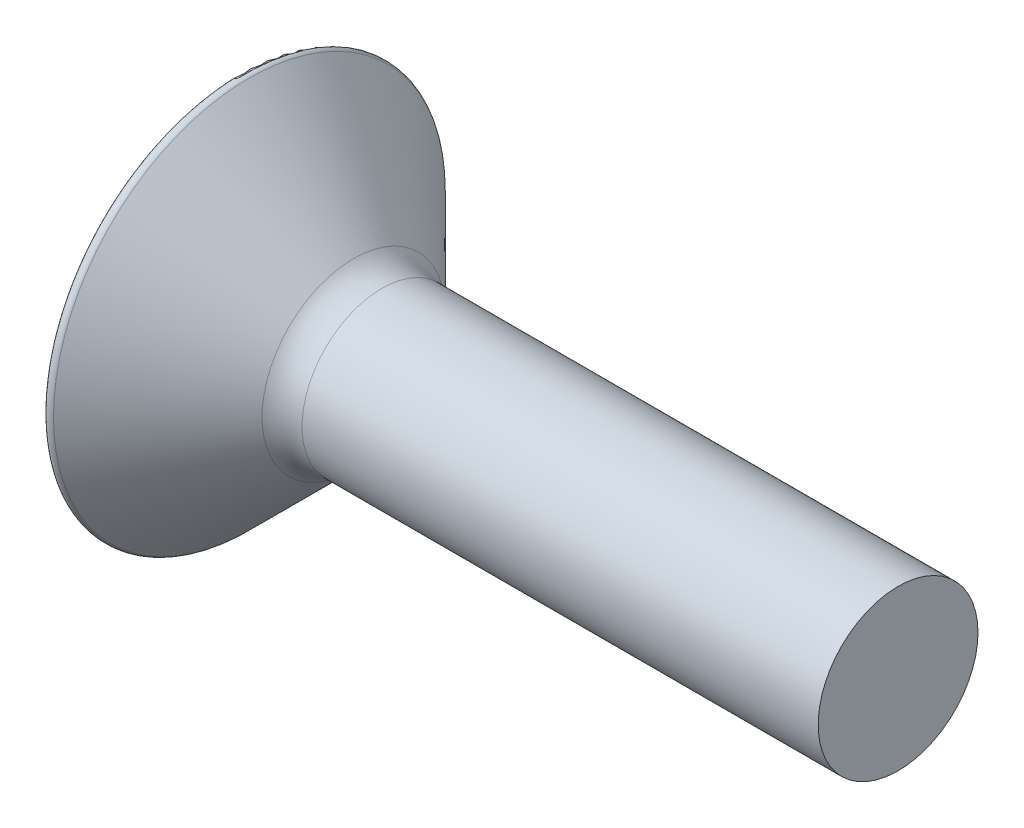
ISO-10303-21;
HEADER;
FILE_DESCRIPTION(('STEP AP214'),'2;1');
FILE_NAME('part.step','',(''),(''),'','','');
FILE_SCHEMA(('AUTOMOTIVE_DESIGN { 1 0 10303 214 1 1 1 1 }'));
ENDSEC;
DATA;
#1=APPLICATION_CONTEXT('core data for automotive mechanical design processes');
#2=APPLICATION_PROTOCOL_DEFINITION('international standard','automotive_design',2000,#1);
#3=PRODUCT_CONTEXT('',#1,'mechanical');
#4=PRODUCT('Part','Part','',(#3));
#5=PRODUCT_RELATED_PRODUCT_CATEGORY('part','',(#4));
#6=PRODUCT_DEFINITION_FORMATION('','',#4);
#7=PRODUCT_DEFINITION_CONTEXT('part definition',#1,'design');
#8=PRODUCT_DEFINITION('design','',#6,#7);
#9=PRODUCT_DEFINITION_SHAPE('','',#8);
#10=(LENGTH_UNIT() NAMED_UNIT(*) SI_UNIT(.MILLI.,.METRE.));
#11=(NAMED_UNIT(*) PLANE_ANGLE_UNIT() SI_UNIT($,.RADIAN.));
#12=(NAMED_UNIT(*) SI_UNIT($,.STERADIAN.) SOLID_ANGLE_UNIT());
#13=UNCERTAINTY_MEASURE_WITH_UNIT(LENGTH_MEASURE(1.E-05),#10,'distance_accuracy_value','');
#14=(GEOMETRIC_REPRESENTATION_CONTEXT(3) GLOBAL_UNCERTAINTY_ASSIGNED_CONTEXT((#13)) GLOBAL_UNIT_ASSIGNED_CONTEXT((#10,
#11,#12)) REPRESENTATION_CONTEXT('',''));
#15=CARTESIAN_POINT('',(0.,0.,0.));
#16=DIRECTION('',(0.,0.,1.));
#17=DIRECTION('',(1.,0.,0.));
#18=AXIS2_PLACEMENT_3D('',#15,#16,#17);
#19=CARTESIAN_POINT('',(28.3800000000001,0.,0.));
#20=DIRECTION('',(0.,0.,1.));
#21=DIRECTION('',(1.,0.,0.));
#22=AXIS2_PLACEMENT_3D('',#19,#20,#21);
#23=SPHERICAL_SURFACE('',#22,29.3800000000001);
#24=CARTESIAN_POINT('',(-0.0885355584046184,0.,0.));
#25=DIRECTION('',(1.,0.,0.));
#26=DIRECTION('',(0.,0.,-1.));
#27=AXIS2_PLACEMENT_3D('',#24,#25,#26);
#28=CIRCLE('',#27,7.26132791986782);
#29=CARTESIAN_POINT('',(-0.0885355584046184,0.,-7.26132791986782));
#30=VERTEX_POINT('',#29);
#31=EDGE_CURVE('E154',#30,#30,#28,.F.);
#32=ORIENTED_EDGE('',*,*,#31,.T.);
#33=EDGE_LOOP('',(#32));
#34=FACE_BOUND('',#33,.T.);
#35=CARTESIAN_POINT('',(28.3800000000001,-1.0375,-1.79700271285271));
#36=DIRECTION('',(0.,0.5,0.866025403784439));
#37=DIRECTION('',(0.,-0.866025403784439,0.5));
#38=AXIS2_PLACEMENT_3D('',#35,#36,#37);
#39=CIRCLE('',#38,29.3066336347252);
#40=CARTESIAN_POINT('',(-0.902137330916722,0.,-2.39600361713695));
#41=VERTEX_POINT('',#40);
#42=CARTESIAN_POINT('',(-0.902137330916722,-2.075,-1.19800180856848));
#43=VERTEX_POINT('',#42);
#44=EDGE_CURVE('E149',#41,#43,#39,.T.);
#45=ORIENTED_EDGE('',*,*,#44,.F.);
#46=CARTESIAN_POINT('',(28.3800000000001,1.0375,-1.79700271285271));
#47=DIRECTION('',(0.,-0.5,0.866025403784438));
#48=DIRECTION('',(0.,-0.866025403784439,-0.5));
#49=AXIS2_PLACEMENT_3D('',#46,#47,#48);
#50=CIRCLE('',#49,29.3066336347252);
#51=CARTESIAN_POINT('',(-0.902137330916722,2.075,-1.19800180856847));
#52=VERTEX_POINT('',#51);
#53=EDGE_CURVE('E60',#52,#41,#50,.T.);
#54=ORIENTED_EDGE('',*,*,#53,.F.);
#55=CARTESIAN_POINT('',(28.3800000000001,2.075,0.));
#56=DIRECTION('',(0.,-1.,0.));
#57=DIRECTION('',(0.,0.,-1.));
#58=AXIS2_PLACEMENT_3D('',#55,#56,#57);
#59=CIRCLE('',#58,29.3066336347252);
#60=CARTESIAN_POINT('',(-0.902137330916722,2.075,1.19800180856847));
#61=VERTEX_POINT('',#60);
#62=EDGE_CURVE('E146',#61,#52,#59,.T.);
#63=ORIENTED_EDGE('',*,*,#62,.F.);
#64=CARTESIAN_POINT('',(28.3800000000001,1.0375,1.79700271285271));
#65=DIRECTION('',(0.,-0.5,-0.866025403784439));
#66=DIRECTION('',(0.,0.866025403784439,-0.5));
#67=AXIS2_PLACEMENT_3D('',#64,#65,#66);
#68=CIRCLE('',#67,29.3066336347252);
#69=CARTESIAN_POINT('',(-0.902137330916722,0.,2.39600361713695));
#70=VERTEX_POINT('',#69);
#71=EDGE_CURVE('E128',#70,#61,#68,.T.);
#72=ORIENTED_EDGE('',*,*,#71,.F.);
#73=CARTESIAN_POINT('',(28.3800000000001,-1.0375,1.79700271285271));
#74=DIRECTION('',(0.,0.5,-0.866025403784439));
#75=DIRECTION('',(0.,0.866025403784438,0.5));
#76=AXIS2_PLACEMENT_3D('',#73,#74,#75);
#77=CIRCLE('',#76,29.3066336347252);
#78=CARTESIAN_POINT('',(-0.902137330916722,-2.075,1.19800180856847));
#79=VERTEX_POINT('',#78);
#80=EDGE_CURVE('E143',#79,#70,#77,.T.);
#81=ORIENTED_EDGE('',*,*,#80,.F.);
#82=CARTESIAN_POINT('',(28.3800000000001,-2.075,0.));
#83=DIRECTION('',(0.,1.,0.));
#84=DIRECTION('',(0.,0.,1.));
#85=AXIS2_PLACEMENT_3D('',#82,#83,#84);
#86=CIRCLE('',#85,29.3066336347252);
#87=EDGE_CURVE('E141',#43,#79,#86,.T.);
#88=ORIENTED_EDGE('',*,*,#87,.F.);
#89=EDGE_LOOP('',(#45,#54,#63,#72,#81,#88));
#90=FACE_BOUND('',#89,.T.);
#91=ADVANCED_FACE('F37',(#34,#90),#23,.T.);
#92=CARTESIAN_POINT('',(4.6,0.,0.));
#93=DIRECTION('',(-1.,0.,0.));
#94=DIRECTION('',(0.,0.,-1.));
#95=AXIS2_PLACEMENT_3D('',#92,#93,#94);
#96=CONICAL_SURFACE('',#95,3.,0.78539816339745);
#97=CARTESIAN_POINT('',(4.16066017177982,0.,0.));
#98=DIRECTION('',(1.,0.,0.));
#99=DIRECTION('',(0.,0.,-1.));
#100=AXIS2_PLACEMENT_3D('',#97,#98,#99);
#101=CIRCLE('',#100,3.43933982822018);
#102=CARTESIAN_POINT('',(4.16066017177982,0.,-3.43933982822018));
#103=VERTEX_POINT('',#102);
#104=EDGE_CURVE('E11',#103,#103,#101,.F.);
#105=ORIENTED_EDGE('',*,*,#104,.T.);
#106=EDGE_LOOP('',(#105));
#107=FACE_BOUND('',#106,.T.);
#108=CARTESIAN_POINT('',(0.246681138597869,0.,0.));
#109=DIRECTION('',(-1.,0.,0.));
#110=DIRECTION('',(0.,0.,1.));
#111=AXIS2_PLACEMENT_3D('',#108,#109,#110);
#112=CIRCLE('',#111,7.35331886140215);
#113=CARTESIAN_POINT('',(0.246681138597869,0.,7.35331886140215));
#114=VERTEX_POINT('',#113);
#115=EDGE_CURVE('E151',#114,#114,#112,.F.);
#116=ORIENTED_EDGE('',*,*,#115,.T.);
#117=EDGE_LOOP('',(#116));
#118=FACE_BOUND('',#117,.T.);
#119=ADVANCED_FACE('F171',(#107,#118),#96,.T.);
#120=CARTESIAN_POINT('',(24.6,0.,0.));
#121=DIRECTION('',(-1.,0.,0.));
#122=DIRECTION('',(0.,0.,1.));
#123=AXIS2_PLACEMENT_3D('',#120,#121,#122);
#124=CYLINDRICAL_SURFACE('',#123,3.);
#125=CARTESIAN_POINT('',(5.22132034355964,0.,0.));
#126=DIRECTION('',(1.,0.,0.));
#127=DIRECTION('',(0.,0.,-1.));
#128=AXIS2_PLACEMENT_3D('',#125,#126,#127);
#129=CIRCLE('',#128,3.);
#130=CARTESIAN_POINT('',(5.22132034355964,0.,-3.));
#131=VERTEX_POINT('',#130);
#132=EDGE_CURVE('E45',#131,#131,#129,.T.);
#133=ORIENTED_EDGE('',*,*,#132,.T.);
#134=EDGE_LOOP('',(#133));
#135=FACE_BOUND('',#134,.T.);
#136=CARTESIAN_POINT('',(24.6,0.,0.));
#137=DIRECTION('',(1.,0.,0.));
#138=DIRECTION('',(0.,0.,-1.));
#139=AXIS2_PLACEMENT_3D('',#136,#137,#138);
#140=CIRCLE('',#139,3.);
#141=CARTESIAN_POINT('',(24.6,0.,-3.));
#142=VERTEX_POINT('',#141);
#143=EDGE_CURVE('E138',#142,#142,#140,.T.);
#144=ORIENTED_EDGE('',*,*,#143,.F.);
#145=EDGE_LOOP('',(#144));
#146=FACE_BOUND('',#145,.T.);
#147=ADVANCED_FACE('F159',(#135,#146),#124,.T.);
#148=CARTESIAN_POINT('',(24.6,0.,0.));
#149=DIRECTION('',(1.,0.,0.));
#150=DIRECTION('',(0.,0.,-1.));
#151=AXIS2_PLACEMENT_3D('',#148,#149,#150);
#152=PLANE('',#151);
#153=ORIENTED_EDGE('',*,*,#143,.T.);
#154=EDGE_LOOP('',(#153));
#155=FACE_BOUND('',#154,.T.);
#156=ADVANCED_FACE('F183',(#155),#152,.T.);
#157=CARTESIAN_POINT('',(2.,-2.075,-1.19800180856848));
#158=DIRECTION('',(0.,0.5,0.866025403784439));
#159=DIRECTION('',(0.,-0.866025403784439,0.5));
#160=AXIS2_PLACEMENT_3D('',#157,#158,#159);
#161=PLANE('',#160);
#162=ORIENTED_EDGE('',*,*,#44,.T.);
#163=DIRECTION('',(-1.,0.,0.));
#164=VECTOR('',#163,1.);
#165=CARTESIAN_POINT('',(2.,-2.075,-1.19800180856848));
#166=LINE('',#165,#164);
#167=CARTESIAN_POINT('',(2.,-2.075,-1.19800180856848));
#168=VERTEX_POINT('',#167);
#169=EDGE_CURVE('E52',#168,#43,#166,.T.);
#170=ORIENTED_EDGE('',*,*,#169,.F.);
#171=DIRECTION('',(0.,0.866025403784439,-0.5));
#172=VECTOR('',#171,1.);
#173=CARTESIAN_POINT('',(2.,-2.075,-1.19800180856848));
#174=LINE('',#173,#172);
#175=CARTESIAN_POINT('',(2.,0.,-2.39600361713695));
#176=VERTEX_POINT('',#175);
#177=EDGE_CURVE('E337',#168,#176,#174,.T.);
#178=ORIENTED_EDGE('',*,*,#177,.T.);
#179=DIRECTION('',(-1.,0.,0.));
#180=VECTOR('',#179,1.);
#181=CARTESIAN_POINT('',(2.,0.,-2.39600361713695));
#182=LINE('',#181,#180);
#183=EDGE_CURVE('E131',#176,#41,#182,.T.);
#184=ORIENTED_EDGE('',*,*,#183,.T.);
#185=EDGE_LOOP('',(#162,#170,#178,#184));
#186=FACE_BOUND('',#185,.T.);
#187=ADVANCED_FACE('F186',(#186),#161,.T.);
#188=CARTESIAN_POINT('',(2.,0.,-2.39600361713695));
#189=DIRECTION('',(0.,-0.5,0.866025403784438));
#190=DIRECTION('',(0.,-0.866025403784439,-0.5));
#191=AXIS2_PLACEMENT_3D('',#188,#189,#190);
#192=PLANE('',#191);
#193=ORIENTED_EDGE('',*,*,#53,.T.);
#194=ORIENTED_EDGE('',*,*,#183,.F.);
#195=DIRECTION('',(0.,0.866025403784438,0.5));
#196=VECTOR('',#195,1.);
#197=CARTESIAN_POINT('',(2.,0.,-2.39600361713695));
#198=LINE('',#197,#196);
#199=CARTESIAN_POINT('',(2.,2.075,-1.19800180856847));
#200=VERTEX_POINT('',#199);
#201=EDGE_CURVE('E124',#176,#200,#198,.T.);
#202=ORIENTED_EDGE('',*,*,#201,.T.);
#203=DIRECTION('',(-1.,0.,0.));
#204=VECTOR('',#203,1.);
#205=CARTESIAN_POINT('',(2.,2.075,-1.19800180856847));
#206=LINE('',#205,#204);
#207=EDGE_CURVE('E123',#200,#52,#206,.T.);
#208=ORIENTED_EDGE('',*,*,#207,.T.);
#209=EDGE_LOOP('',(#193,#194,#202,#208));
#210=FACE_BOUND('',#209,.T.);
#211=ADVANCED_FACE('F190',(#210),#192,.T.);
#212=CARTESIAN_POINT('',(2.,2.075,-1.19800180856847));
#213=DIRECTION('',(0.,-1.,0.));
#214=DIRECTION('',(0.,0.,-1.));
#215=AXIS2_PLACEMENT_3D('',#212,#213,#214);
#216=PLANE('',#215);
#217=ORIENTED_EDGE('',*,*,#62,.T.);
#218=ORIENTED_EDGE('',*,*,#207,.F.);
#219=DIRECTION('',(0.,0.,1.));
#220=VECTOR('',#219,1.);
#221=CARTESIAN_POINT('',(2.,2.075,-1.19800180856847));
#222=LINE('',#221,#220);
#223=CARTESIAN_POINT('',(2.,2.075,1.19800180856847));
#224=VERTEX_POINT('',#223);
#225=EDGE_CURVE('E100',#200,#224,#222,.T.);
#226=ORIENTED_EDGE('',*,*,#225,.T.);
#227=DIRECTION('',(-1.,0.,0.));
#228=VECTOR('',#227,1.);
#229=CARTESIAN_POINT('',(2.,2.075,1.19800180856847));
#230=LINE('',#229,#228);
#231=EDGE_CURVE('E121',#224,#61,#230,.T.);
#232=ORIENTED_EDGE('',*,*,#231,.T.);
#233=EDGE_LOOP('',(#217,#218,#226,#232));
#234=FACE_BOUND('',#233,.T.);
#235=ADVANCED_FACE('F120',(#234),#216,.T.);
#236=CARTESIAN_POINT('',(2.,2.075,1.19800180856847));
#237=DIRECTION('',(0.,-0.5,-0.866025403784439));
#238=DIRECTION('',(0.,0.866025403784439,-0.5));
#239=AXIS2_PLACEMENT_3D('',#236,#237,#238);
#240=PLANE('',#239);
#241=ORIENTED_EDGE('',*,*,#71,.T.);
#242=ORIENTED_EDGE('',*,*,#231,.F.);
#243=DIRECTION('',(0.,-0.866025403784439,0.5));
#244=VECTOR('',#243,1.);
#245=CARTESIAN_POINT('',(2.,2.075,1.19800180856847));
#246=LINE('',#245,#244);
#247=CARTESIAN_POINT('',(2.,0.,2.39600361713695));
#248=VERTEX_POINT('',#247);
#249=EDGE_CURVE('E107',#224,#248,#246,.T.);
#250=ORIENTED_EDGE('',*,*,#249,.T.);
#251=DIRECTION('',(-1.,0.,0.));
#252=VECTOR('',#251,1.);
#253=CARTESIAN_POINT('',(2.,0.,2.39600361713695));
#254=LINE('',#253,#252);
#255=EDGE_CURVE('E129',#248,#70,#254,.T.);
#256=ORIENTED_EDGE('',*,*,#255,.T.);
#257=EDGE_LOOP('',(#241,#242,#250,#256));
#258=FACE_BOUND('',#257,.T.);
#259=ADVANCED_FACE('F126',(#258),#240,.T.);
#260=CARTESIAN_POINT('',(2.,0.,2.39600361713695));
#261=DIRECTION('',(0.,0.5,-0.866025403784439));
#262=DIRECTION('',(0.,0.866025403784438,0.5));
#263=AXIS2_PLACEMENT_3D('',#260,#261,#262);
#264=PLANE('',#263);
#265=ORIENTED_EDGE('',*,*,#80,.T.);
#266=ORIENTED_EDGE('',*,*,#255,.F.);
#267=DIRECTION('',(0.,-0.866025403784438,-0.5));
#268=VECTOR('',#267,1.);
#269=CARTESIAN_POINT('',(2.,0.,2.39600361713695));
#270=LINE('',#269,#268);
#271=CARTESIAN_POINT('',(2.,-2.075,1.19800180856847));
#272=VERTEX_POINT('',#271);
#273=EDGE_CURVE('E115',#248,#272,#270,.T.);
#274=ORIENTED_EDGE('',*,*,#273,.T.);
#275=DIRECTION('',(-1.,0.,0.));
#276=VECTOR('',#275,1.);
#277=CARTESIAN_POINT('',(2.,-2.075,1.19800180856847));
#278=LINE('',#277,#276);
#279=EDGE_CURVE('E133',#272,#79,#278,.T.);
#280=ORIENTED_EDGE('',*,*,#279,.T.);
#281=EDGE_LOOP('',(#265,#266,#274,#280));
#282=FACE_BOUND('',#281,.T.);
#283=ADVANCED_FACE('F198',(#282),#264,.T.);
#284=CARTESIAN_POINT('',(2.,-2.075,1.19800180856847));
#285=DIRECTION('',(0.,1.,0.));
#286=DIRECTION('',(0.,0.,1.));
#287=AXIS2_PLACEMENT_3D('',#284,#285,#286);
#288=PLANE('',#287);
#289=ORIENTED_EDGE('',*,*,#87,.T.);
#290=ORIENTED_EDGE('',*,*,#279,.F.);
#291=DIRECTION('',(0.,0.,-1.));
#292=VECTOR('',#291,1.);
#293=CARTESIAN_POINT('',(2.,-2.075,1.19800180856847));
#294=LINE('',#293,#292);
#295=EDGE_CURVE('E350',#272,#168,#294,.T.);
#296=ORIENTED_EDGE('',*,*,#295,.T.);
#297=ORIENTED_EDGE('',*,*,#169,.T.);
#298=EDGE_LOOP('',(#289,#290,#296,#297));
#299=FACE_BOUND('',#298,.T.);
#300=ADVANCED_FACE('F201',(#299),#288,.T.);
#301=CARTESIAN_POINT('',(2.,2.075,1.19800180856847));
#302=DIRECTION('',(0.86602540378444,0.249999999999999,0.433012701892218));
#303=DIRECTION('',(0.447213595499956,0.,-0.894427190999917));
#304=AXIS2_PLACEMENT_3D('',#301,#302,#303);
#305=PLANE('',#304);
#306=ORIENTED_EDGE('',*,*,#249,.F.);
#307=DIRECTION('',(-0.447213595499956,0.774596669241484,0.447213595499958));
#308=VECTOR('',#307,1.);
#309=CARTESIAN_POINT('',(2.,2.075,1.19800180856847));
#310=LINE('',#309,#308);
#311=CARTESIAN_POINT('',(3.19800180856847,0.,0.));
#312=VERTEX_POINT('',#311);
#313=EDGE_CURVE('E96',#312,#224,#310,.T.);
#314=ORIENTED_EDGE('',*,*,#313,.F.);
#315=DIRECTION('',(-0.447213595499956,0.,0.894427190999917));
#316=VECTOR('',#315,1.);
#317=CARTESIAN_POINT('',(2.,0.,2.39600361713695));
#318=LINE('',#317,#316);
#319=EDGE_CURVE('E109',#312,#248,#318,.T.);
#320=ORIENTED_EDGE('',*,*,#319,.T.);
#321=EDGE_LOOP('',(#306,#314,#320));
#322=FACE_BOUND('',#321,.T.);
#323=ADVANCED_FACE('F108',(#322),#305,.F.);
#324=CARTESIAN_POINT('',(2.,0.,2.39600361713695));
#325=DIRECTION('',(0.86602540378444,-0.249999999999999,0.433012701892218));
#326=DIRECTION('',(0.447213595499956,0.,-0.894427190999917));
#327=AXIS2_PLACEMENT_3D('',#324,#325,#326);
#328=PLANE('',#327);
#329=ORIENTED_EDGE('',*,*,#273,.F.);
#330=ORIENTED_EDGE('',*,*,#319,.F.);
#331=DIRECTION('',(-0.447213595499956,-0.774596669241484,0.447213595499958));
#332=VECTOR('',#331,1.);
#333=CARTESIAN_POINT('',(2.,-2.075,1.19800180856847));
#334=LINE('',#333,#332);
#335=EDGE_CURVE('E343',#312,#272,#334,.T.);
#336=ORIENTED_EDGE('',*,*,#335,.T.);
#337=EDGE_LOOP('',(#329,#330,#336));
#338=FACE_BOUND('',#337,.T.);
#339=ADVANCED_FACE('F205',(#338),#328,.F.);
#340=CARTESIAN_POINT('',(2.,-2.075,1.19800180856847));
#341=DIRECTION('',(0.86602540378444,-0.499999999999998,0.));
#342=DIRECTION('',(0.499999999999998,0.86602540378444,0.));
#343=AXIS2_PLACEMENT_3D('',#340,#341,#342);
#344=PLANE('',#343);
#345=ORIENTED_EDGE('',*,*,#295,.F.);
#346=ORIENTED_EDGE('',*,*,#335,.F.);
#347=DIRECTION('',(-0.447213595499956,-0.774596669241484,-0.447213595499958));
#348=VECTOR('',#347,1.);
#349=CARTESIAN_POINT('',(2.,-2.075,-1.19800180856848));
#350=LINE('',#349,#348);
#351=EDGE_CURVE('E357',#312,#168,#350,.T.);
#352=ORIENTED_EDGE('',*,*,#351,.T.);
#353=EDGE_LOOP('',(#345,#346,#352));
#354=FACE_BOUND('',#353,.T.);
#355=ADVANCED_FACE('F208',(#354),#344,.F.);
#356=CARTESIAN_POINT('',(2.,-2.075,-1.19800180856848));
#357=DIRECTION('',(0.86602540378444,-0.249999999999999,-0.433012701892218));
#358=DIRECTION('',(-0.447213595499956,0.,-0.894427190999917));
#359=AXIS2_PLACEMENT_3D('',#356,#357,#358);
#360=PLANE('',#359);
#361=ORIENTED_EDGE('',*,*,#177,.F.);
#362=ORIENTED_EDGE('',*,*,#351,.F.);
#363=DIRECTION('',(-0.447213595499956,0.,-0.894427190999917));
#364=VECTOR('',#363,1.);
#365=CARTESIAN_POINT('',(2.,0.,-2.39600361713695));
#366=LINE('',#365,#364);
#367=EDGE_CURVE('E336',#312,#176,#366,.T.);
#368=ORIENTED_EDGE('',*,*,#367,.T.);
#369=EDGE_LOOP('',(#361,#362,#368));
#370=FACE_BOUND('',#369,.T.);
#371=ADVANCED_FACE('F212',(#370),#360,.F.);
#372=CARTESIAN_POINT('',(2.,0.,-2.39600361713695));
#373=DIRECTION('',(0.86602540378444,0.249999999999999,-0.433012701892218));
#374=DIRECTION('',(-0.447213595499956,0.,-0.894427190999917));
#375=AXIS2_PLACEMENT_3D('',#372,#373,#374);
#376=PLANE('',#375);
#377=ORIENTED_EDGE('',*,*,#201,.F.);
#378=ORIENTED_EDGE('',*,*,#367,.F.);
#379=DIRECTION('',(-0.447213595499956,0.774596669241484,-0.447213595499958));
#380=VECTOR('',#379,1.);
#381=CARTESIAN_POINT('',(2.,2.075,-1.19800180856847));
#382=LINE('',#381,#380);
#383=EDGE_CURVE('E102',#312,#200,#382,.T.);
#384=ORIENTED_EDGE('',*,*,#383,.T.);
#385=EDGE_LOOP('',(#377,#378,#384));
#386=FACE_BOUND('',#385,.T.);
#387=ADVANCED_FACE('F216',(#386),#376,.F.);
#388=CARTESIAN_POINT('',(2.,2.075,-1.19800180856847));
#389=DIRECTION('',(0.86602540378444,0.499999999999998,0.));
#390=DIRECTION('',(-0.499999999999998,0.86602540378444,0.));
#391=AXIS2_PLACEMENT_3D('',#388,#389,#390);
#392=PLANE('',#391);
#393=ORIENTED_EDGE('',*,*,#225,.F.);
#394=ORIENTED_EDGE('',*,*,#383,.F.);
#395=ORIENTED_EDGE('',*,*,#313,.T.);
#396=EDGE_LOOP('',(#393,#394,#395));
#397=FACE_BOUND('',#396,.T.);
#398=ADVANCED_FACE('F98',(#397),#392,.F.);
#399=CARTESIAN_POINT('',(0.105259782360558,0.,0.));
#400=DIRECTION('',(1.,0.,0.));
#401=DIRECTION('',(0.,0.,-1.));
#402=AXIS2_PLACEMENT_3D('',#399,#400,#401);
#403=TOROIDAL_SURFACE('',#402,7.21189750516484,0.2);
#404=ORIENTED_EDGE('',*,*,#31,.F.);
#405=EDGE_LOOP('',(#404));
#406=FACE_BOUND('',#405,.T.);
#407=ORIENTED_EDGE('',*,*,#115,.F.);
#408=EDGE_LOOP('',(#407));
#409=FACE_BOUND('',#408,.T.);
#410=ADVANCED_FACE('F163',(#406,#409),#403,.T.);
#411=CARTESIAN_POINT('',(5.22132034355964,0.,0.));
#412=DIRECTION('',(1.,0.,0.));
#413=DIRECTION('',(0.,0.,-1.));
#414=AXIS2_PLACEMENT_3D('',#411,#412,#413);
#415=TOROIDAL_SURFACE('',#414,4.5,1.5);
#416=ORIENTED_EDGE('',*,*,#104,.F.);
#417=EDGE_LOOP('',(#416));
#418=FACE_BOUND('',#417,.T.);
#419=ORIENTED_EDGE('',*,*,#132,.F.);
#420=EDGE_LOOP('',(#419));
#421=FACE_BOUND('',#420,.T.);
#422=ADVANCED_FACE('F39',(#418,#421),#415,.F.);
#423=CLOSED_SHELL('',(#91,#119,#147,#156,#187,#211,#235,#259,#283,#300,#323,#339,#355,#371,#387,
#398,#410,#422));
#424=MANIFOLD_SOLID_BREP('B2',#423);
#425=ADVANCED_BREP_SHAPE_REPRESENTATION('',(#18,#424),#14);
#426=SHAPE_DEFINITION_REPRESENTATION(#9,#425);
ENDSEC;
END-ISO-10303-21;
